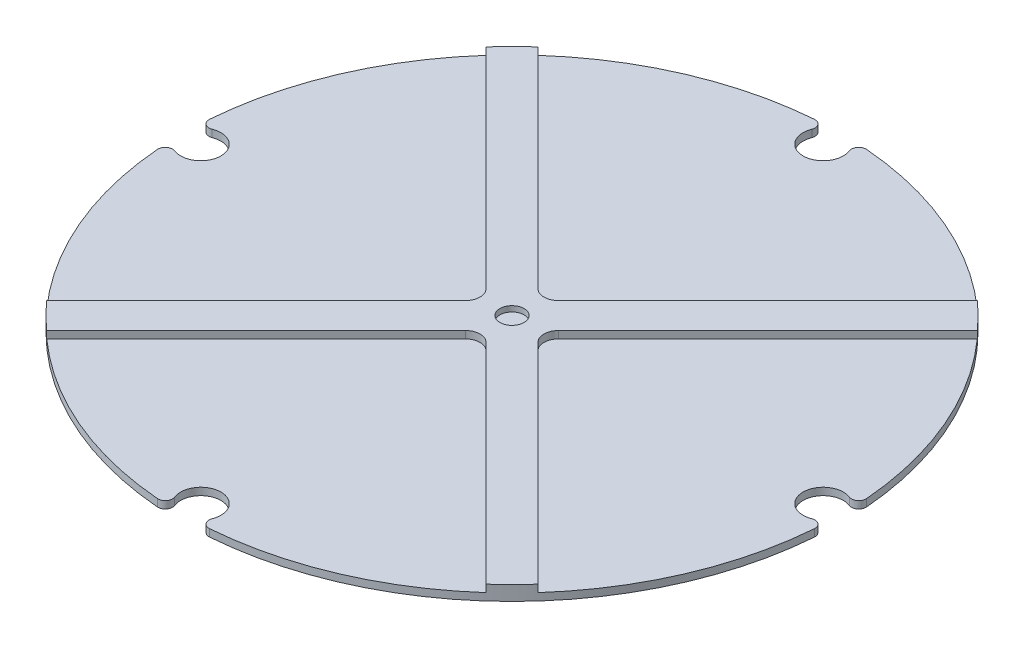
from build123d import *

# Parameters (mm, degrees)
SKETCH1_R           = 45
BOSS_EXTRUDE1_DEPTH = 1
SKETCH2_R           = 2.75
CUT_EXTRUDE4_DEPTH  = 1
FILLET1_R           = 1
BOSS_EXTRUDE2_DEPTH = 1
SKETCH4_R           = 1.65
CUT_EXTRUDE5_DEPTH  = 0.75


with BuildPart() as part:
    # Sketch1 → Boss-Extrude1 (new body)
    with BuildSketch(Plane(origin=(0, 0, 0), x_dir=(1, 0, 0), z_dir=(0, 1, 0))):
        with Locations(Location((0, 0, 0), (0, 0, 270))):
            Circle(SKETCH1_R)
    extrude(amount=BOSS_EXTRUDE1_DEPTH)

    # Sketch2 → Cut-Extrude4 (cut)
    with BuildSketch(Plane(origin=(0, 1, 0), x_dir=(1, 0, 0), z_dir=(0, 1, 0))):
        with Locations((0, 42.5)):
            Circle(SKETCH2_R)
        with Locations((42.5, 0)):
            Circle(SKETCH2_R)
        with Locations((0, -42.5)):
            Circle(SKETCH2_R)
        with Locations((-42.5, 0)):
            Circle(SKETCH2_R)
    extrude(amount=-CUT_EXTRUDE4_DEPTH, mode=Mode.SUBTRACT)

    # Fillet1
    fillet1_edges = [part.edges().sort_by_distance(p)[0] for p in [
        (44.984558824, 0.5, 1.17875674),
        (44.984558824, 0.5, -1.17875674),
        (-1.17875674, 0.5, 44.984558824),
        (1.17875674, 0.5, 44.984558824),
        (-44.984558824, 0.5, -1.17875674),
        (-44.984558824, 0.5, 1.17875674),
        (1.17875674, 0.5, -44.984558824),
        (-1.17875674, 0.5, -44.984558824),
    ]]
    fillet(fillet1_edges, radius=FILLET1_R)

    # Sketch3 → Boss-Extrude2 (add)
    with BuildSketch(Plane(origin=(0, 1, 0), x_dir=(1, 0, 0), z_dir=(0, 1, 0))):
        with BuildLine():
            Line((-30.002895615, 33.538429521), (-1.414213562, 4.949747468))
            ThreePointArc((-1.414213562, 4.949747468), (0, 4.363961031), (1.414213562, 4.949747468))
            Line((1.414213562, 4.949747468), (30.002895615, 33.538429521))
            ThreePointArc((30.002895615, 33.538429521), (31.819805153, 31.819805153), (33.538429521, 30.002895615))
            Line((33.538429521, 30.002895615), (4.949747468, 1.414213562))
            ThreePointArc((4.949747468, 1.414213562), (4.363961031, 0), (4.949747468, -1.414213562))
            Line((4.949747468, -1.414213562), (33.538429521, -30.002895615))
            ThreePointArc((33.538429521, -30.002895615), (31.819805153, -31.819805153), (30.002895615, -33.538429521))
            Line((30.002895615, -33.538429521), (1.414213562, -4.949747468))
            ThreePointArc((1.414213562, -4.949747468), (0, -4.363961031), (-1.414213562, -4.949747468))
            Line((-1.414213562, -4.949747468), (-30.002895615, -33.538429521))
            ThreePointArc((-30.002895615, -33.538429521), (-31.819805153, -31.819805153), (-33.538429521, -30.002895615))
            Line((-33.538429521, -30.002895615), (-4.949747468, -1.414213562))
            ThreePointArc((-4.949747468, -1.414213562), (-4.363961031, 0), (-4.949747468, 1.414213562))
            Line((-4.949747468, 1.414213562), (-33.538429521, 30.002895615))
            ThreePointArc((-33.538429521, 30.002895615), (-31.819805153, 31.819805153), (-30.002895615, 33.538429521))
        make_face()
    extrude(amount=BOSS_EXTRUDE2_DEPTH)

    # Sketch4 → Cut-Extrude5 (cut)
    with BuildSketch(Plane(origin=(0, 2, 0), x_dir=(1, 0, 0), z_dir=(0, 1, 0))):
        with Locations(Location((0, 0, 0), (0, 0, 270))):
            Circle(SKETCH4_R)
    extrude(amount=-CUT_EXTRUDE5_DEPTH, mode=Mode.SUBTRACT)


solid = part.part
